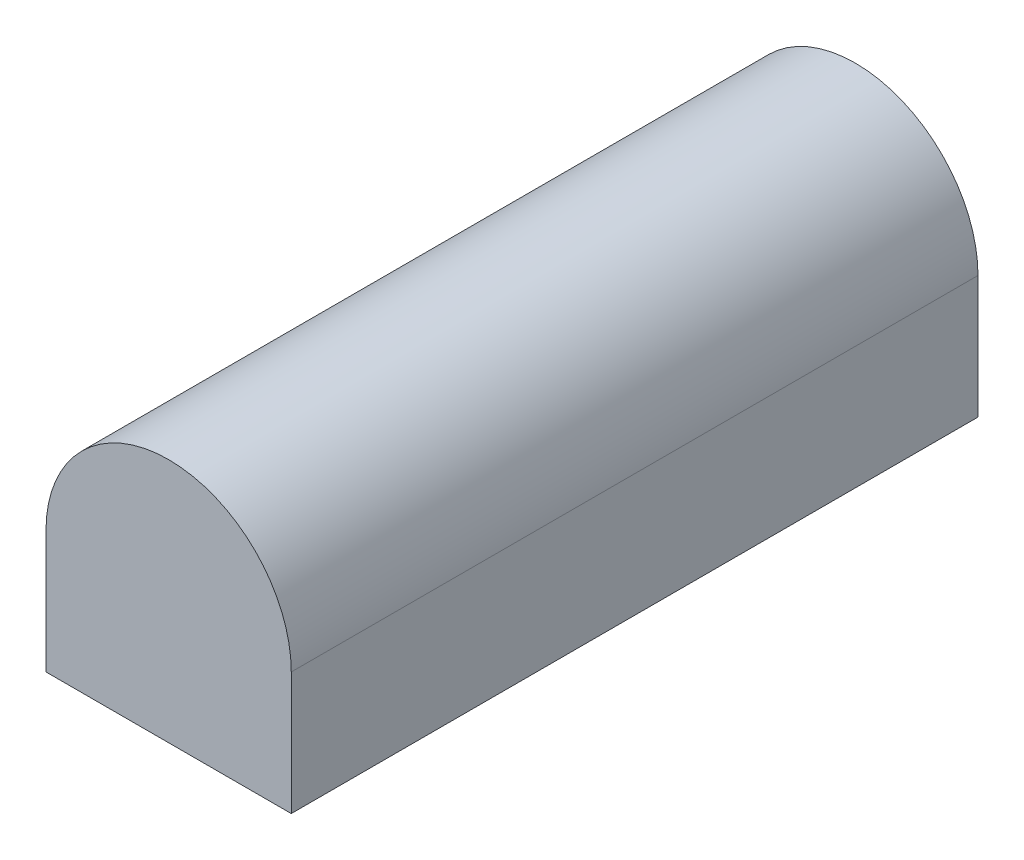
ISO-10303-21;
HEADER;
FILE_DESCRIPTION(('STEP AP214'),'2;1');
FILE_NAME('part.step','',(''),(''),'','','');
FILE_SCHEMA(('AUTOMOTIVE_DESIGN { 1 0 10303 214 1 1 1 1 }'));
ENDSEC;
DATA;
#1=APPLICATION_CONTEXT('core data for automotive mechanical design processes');
#2=APPLICATION_PROTOCOL_DEFINITION('international standard','automotive_design',2000,#1);
#3=PRODUCT_CONTEXT('',#1,'mechanical');
#4=PRODUCT('Part','Part','',(#3));
#5=PRODUCT_RELATED_PRODUCT_CATEGORY('part','',(#4));
#6=PRODUCT_DEFINITION_FORMATION('','',#4);
#7=PRODUCT_DEFINITION_CONTEXT('part definition',#1,'design');
#8=PRODUCT_DEFINITION('design','',#6,#7);
#9=PRODUCT_DEFINITION_SHAPE('','',#8);
#10=(LENGTH_UNIT() NAMED_UNIT(*) SI_UNIT(.MILLI.,.METRE.));
#11=(NAMED_UNIT(*) PLANE_ANGLE_UNIT() SI_UNIT($,.RADIAN.));
#12=(NAMED_UNIT(*) SI_UNIT($,.STERADIAN.) SOLID_ANGLE_UNIT());
#13=UNCERTAINTY_MEASURE_WITH_UNIT(LENGTH_MEASURE(1.E-05),#10,'distance_accuracy_value','');
#14=(GEOMETRIC_REPRESENTATION_CONTEXT(3) GLOBAL_UNCERTAINTY_ASSIGNED_CONTEXT((#13)) GLOBAL_UNIT_ASSIGNED_CONTEXT((#10,
#11,#12)) REPRESENTATION_CONTEXT('',''));
#15=CARTESIAN_POINT('',(0.,0.,0.));
#16=DIRECTION('',(0.,0.,1.));
#17=DIRECTION('',(1.,0.,0.));
#18=AXIS2_PLACEMENT_3D('',#15,#16,#17);
#19=CARTESIAN_POINT('',(3.6432,-3.139537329,18.3432));
#20=DIRECTION('',(0.,1.,0.));
#21=DIRECTION('',(0.,0.,-1.));
#22=AXIS2_PLACEMENT_3D('',#19,#20,#21);
#23=PLANE('',#22);
#24=CARTESIAN_POINT('',(0.,-3.139537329,14.7));
#25=DIRECTION('',(0.,-1.,0.));
#26=DIRECTION('',(0.,0.,-1.));
#27=AXIS2_PLACEMENT_3D('',#24,#25,#26);
#28=CIRCLE('',#27,3.6);
#29=CARTESIAN_POINT('',(0.,-3.139537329,11.1));
#30=VERTEX_POINT('',#29);
#31=EDGE_CURVE('P0_E19',#30,#30,#28,.T.);
#32=ORIENTED_EDGE('',*,*,#31,.F.);
#33=EDGE_LOOP('',(#32));
#34=FACE_BOUND('',#33,.T.);
#35=ADVANCED_FACE('P0_F15',(#34),#23,.T.);
#36=CARTESIAN_POINT('',(0.,26.832462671,14.7));
#37=DIRECTION('',(0.,-1.,0.));
#38=DIRECTION('',(0.,0.,-1.));
#39=AXIS2_PLACEMENT_3D('',#36,#37,#38);
#40=CYLINDRICAL_SURFACE('',#39,3.6);
#41=CARTESIAN_POINT('',(0.,26.832462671,14.7));
#42=DIRECTION('',(0.,-1.,0.));
#43=DIRECTION('',(0.,0.,-1.));
#44=AXIS2_PLACEMENT_3D('',#41,#42,#43);
#45=CIRCLE('',#44,3.6);
#46=CARTESIAN_POINT('',(0.,26.832462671,11.1));
#47=VERTEX_POINT('',#46);
#48=EDGE_CURVE('P0_E205',#47,#47,#45,.T.);
#49=ORIENTED_EDGE('',*,*,#48,.F.);
#50=EDGE_LOOP('',(#49));
#51=FACE_BOUND('',#50,.T.);
#52=ORIENTED_EDGE('',*,*,#31,.T.);
#53=EDGE_LOOP('',(#52));
#54=FACE_BOUND('',#53,.T.);
#55=ADVANCED_FACE('P0_F212',(#51,#54),#40,.F.);
#56=CARTESIAN_POINT('',(5.6672,26.832462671,20.3672));
#57=DIRECTION('',(0.,1.,0.));
#58=DIRECTION('',(0.,0.,-1.));
#59=AXIS2_PLACEMENT_3D('',#56,#57,#58);
#60=PLANE('',#59);
#61=ORIENTED_EDGE('',*,*,#48,.T.);
#62=EDGE_LOOP('',(#61));
#63=FACE_BOUND('',#62,.T.);
#64=CARTESIAN_POINT('',(0.,26.832462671,14.7));
#65=DIRECTION('',(0.,-1.,0.));
#66=DIRECTION('',(0.,0.,-1.));
#67=AXIS2_PLACEMENT_3D('',#64,#65,#66);
#68=CIRCLE('',#67,5.6);
#69=CARTESIAN_POINT('',(0.,26.832462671,9.1));
#70=VERTEX_POINT('',#69);
#71=EDGE_CURVE('P0_E203',#70,#70,#68,.F.);
#72=ORIENTED_EDGE('',*,*,#71,.T.);
#73=EDGE_LOOP('',(#72));
#74=FACE_BOUND('',#73,.T.);
#75=ADVANCED_FACE('P0_F220',(#63,#74),#60,.T.);
#76=CARTESIAN_POINT('',(0.,26.832462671,14.7));
#77=DIRECTION('',(0.,-1.,0.));
#78=DIRECTION('',(0.,0.,-1.));
#79=AXIS2_PLACEMENT_3D('',#76,#77,#78);
#80=CYLINDRICAL_SURFACE('',#79,5.6);
#81=CARTESIAN_POINT('',(0.,-3.139537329,14.7));
#82=DIRECTION('',(0.,-1.,0.));
#83=DIRECTION('',(0.,0.,-1.));
#84=AXIS2_PLACEMENT_3D('',#81,#82,#83);
#85=CIRCLE('',#84,5.6);
#86=CARTESIAN_POINT('',(0.,-3.139537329,9.1));
#87=VERTEX_POINT('',#86);
#88=EDGE_CURVE('P0_E200',#87,#87,#85,.T.);
#89=ORIENTED_EDGE('',*,*,#88,.F.);
#90=EDGE_LOOP('',(#89));
#91=FACE_BOUND('',#90,.T.);
#92=ORIENTED_EDGE('',*,*,#71,.F.);
#93=EDGE_LOOP('',(#92));
#94=FACE_BOUND('',#93,.T.);
#95=ADVANCED_FACE('P0_F317',(#91,#94),#80,.T.);
#96=CARTESIAN_POINT('',(6.28452,-3.139537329,20.98452));
#97=DIRECTION('',(0.,1.,0.));
#98=DIRECTION('',(0.,0.,-1.));
#99=AXIS2_PLACEMENT_3D('',#96,#97,#98);
#100=PLANE('',#99);
#101=ORIENTED_EDGE('',*,*,#88,.T.);
#102=EDGE_LOOP('',(#101));
#103=FACE_BOUND('',#102,.T.);
#104=CARTESIAN_POINT('',(0.,-3.139537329,14.7));
#105=DIRECTION('',(0.,1.,0.));
#106=DIRECTION('',(0.,0.,1.));
#107=AXIS2_PLACEMENT_3D('',#104,#105,#106);
#108=CIRCLE('',#107,6.21);
#109=CARTESIAN_POINT('',(0.,-3.139537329,20.91));
#110=VERTEX_POINT('',#109);
#111=EDGE_CURVE('P0_E197',#110,#110,#108,.T.);
#112=ORIENTED_EDGE('',*,*,#111,.T.);
#113=EDGE_LOOP('',(#112));
#114=FACE_BOUND('',#113,.T.);
#115=ADVANCED_FACE('P0_F315',(#103,#114),#100,.T.);
#116=CARTESIAN_POINT('',(0.,-4.639537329,14.7));
#117=DIRECTION('',(0.,1.,0.));
#118=DIRECTION('',(0.,0.,1.));
#119=AXIS2_PLACEMENT_3D('',#116,#117,#118);
#120=CYLINDRICAL_SURFACE('',#119,6.21);
#121=CARTESIAN_POINT('',(0.,-4.639537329,14.7));
#122=DIRECTION('',(0.,1.,0.));
#123=DIRECTION('',(0.,0.,1.));
#124=AXIS2_PLACEMENT_3D('',#121,#122,#123);
#125=CIRCLE('',#124,6.21);
#126=CARTESIAN_POINT('',(0.,-4.639537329,20.91));
#127=VERTEX_POINT('',#126);
#128=EDGE_CURVE('P0_E194',#127,#127,#125,.F.);
#129=ORIENTED_EDGE('',*,*,#128,.F.);
#130=EDGE_LOOP('',(#129));
#131=FACE_BOUND('',#130,.T.);
#132=ORIENTED_EDGE('',*,*,#111,.F.);
#133=EDGE_LOOP('',(#132));
#134=FACE_BOUND('',#133,.T.);
#135=ADVANCED_FACE('P0_F312',(#131,#134),#120,.T.);
#136=CARTESIAN_POINT('',(8.349,-4.639537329,23.049));
#137=DIRECTION('',(0.,1.,0.));
#138=DIRECTION('',(0.,0.,-1.));
#139=AXIS2_PLACEMENT_3D('',#136,#137,#138);
#140=PLANE('',#139);
#141=ORIENTED_EDGE('',*,*,#128,.T.);
#142=EDGE_LOOP('',(#141));
#143=FACE_BOUND('',#142,.T.);
#144=CARTESIAN_POINT('',(0.,-4.639537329,14.7));
#145=DIRECTION('',(0.,1.,0.));
#146=DIRECTION('',(0.,0.,1.));
#147=AXIS2_PLACEMENT_3D('',#144,#145,#146);
#148=CIRCLE('',#147,8.25);
#149=CARTESIAN_POINT('',(0.,-4.639537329,22.95));
#150=VERTEX_POINT('',#149);
#151=EDGE_CURVE('P0_E191',#150,#150,#148,.F.);
#152=ORIENTED_EDGE('',*,*,#151,.F.);
#153=EDGE_LOOP('',(#152));
#154=FACE_BOUND('',#153,.T.);
#155=ADVANCED_FACE('P0_F310',(#143,#154),#140,.T.);
#156=CARTESIAN_POINT('',(0.,-4.639537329,14.7));
#157=DIRECTION('',(0.,1.,0.));
#158=DIRECTION('',(0.,0.,1.));
#159=AXIS2_PLACEMENT_3D('',#156,#157,#158);
#160=CYLINDRICAL_SURFACE('',#159,8.25);
#161=CARTESIAN_POINT('',(0.,-3.139537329,14.7));
#162=DIRECTION('',(0.,1.,0.));
#163=DIRECTION('',(0.,0.,1.));
#164=AXIS2_PLACEMENT_3D('',#161,#162,#163);
#165=CIRCLE('',#164,8.25);
#166=CARTESIAN_POINT('',(0.,-3.139537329,22.95));
#167=VERTEX_POINT('',#166);
#168=EDGE_CURVE('P0_E188',#167,#167,#165,.F.);
#169=ORIENTED_EDGE('',*,*,#168,.F.);
#170=EDGE_LOOP('',(#169));
#171=FACE_BOUND('',#170,.T.);
#172=ORIENTED_EDGE('',*,*,#151,.T.);
#173=EDGE_LOOP('',(#172));
#174=FACE_BOUND('',#173,.T.);
#175=ADVANCED_FACE('P0_F306',(#171,#174),#160,.F.);
#176=CARTESIAN_POINT('',(-5.7938,-12.005737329,43.86));
#177=DIRECTION('',(0.,0.,1.));
#178=DIRECTION('',(0.,1.,0.));
#179=AXIS2_PLACEMENT_3D('',#176,#177,#178);
#180=PLANE('',#179);
#181=CARTESIAN_POINT('',(-7.16,-10.639537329,43.86));
#182=DIRECTION('',(0.,0.,-1.));
#183=DIRECTION('',(-1.,0.,0.));
#184=AXIS2_PLACEMENT_3D('',#181,#182,#183);
#185=CIRCLE('',#184,1.35);
#186=CARTESIAN_POINT('',(-8.51,-10.639537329,43.86));
#187=VERTEX_POINT('',#186);
#188=EDGE_CURVE('P0_E185',#187,#187,#185,.F.);
#189=ORIENTED_EDGE('',*,*,#188,.T.);
#190=EDGE_LOOP('',(#189));
#191=FACE_BOUND('',#190,.T.);
#192=ADVANCED_FACE('P0_F309',(#191),#180,.T.);
#193=CARTESIAN_POINT('',(3.6662,-11.005737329,43.86));
#194=DIRECTION('',(0.,0.,1.));
#195=DIRECTION('',(0.,1.,0.));
#196=AXIS2_PLACEMENT_3D('',#193,#194,#195);
#197=PLANE('',#196);
#198=CARTESIAN_POINT('',(2.3,-9.639537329,43.86));
#199=DIRECTION('',(0.,0.,-1.));
#200=DIRECTION('',(-1.,0.,0.));
#201=AXIS2_PLACEMENT_3D('',#198,#199,#200);
#202=CIRCLE('',#201,1.35);
#203=CARTESIAN_POINT('',(0.949999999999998,-9.639537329,43.86));
#204=VERTEX_POINT('',#203);
#205=EDGE_CURVE('P0_E182',#204,#204,#202,.F.);
#206=ORIENTED_EDGE('',*,*,#205,.T.);
#207=EDGE_LOOP('',(#206));
#208=FACE_BOUND('',#207,.T.);
#209=ADVANCED_FACE('P0_F341',(#208),#197,.T.);
#210=CARTESIAN_POINT('',(8.3662,-11.005737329,43.86));
#211=DIRECTION('',(0.,0.,1.));
#212=DIRECTION('',(0.,1.,0.));
#213=AXIS2_PLACEMENT_3D('',#210,#211,#212);
#214=PLANE('',#213);
#215=CARTESIAN_POINT('',(7.,-9.639537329,43.86));
#216=DIRECTION('',(0.,0.,-1.));
#217=DIRECTION('',(-1.,0.,0.));
#218=AXIS2_PLACEMENT_3D('',#215,#216,#217);
#219=CIRCLE('',#218,1.35);
#220=CARTESIAN_POINT('',(5.65,-9.639537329,43.86));
#221=VERTEX_POINT('',#220);
#222=EDGE_CURVE('P0_E179',#221,#221,#219,.F.);
#223=ORIENTED_EDGE('',*,*,#222,.T.);
#224=EDGE_LOOP('',(#223));
#225=FACE_BOUND('',#224,.T.);
#226=ADVANCED_FACE('P0_F345',(#225),#214,.T.);
#227=CARTESIAN_POINT('',(-5.7338,-17.005737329,43.86));
#228=DIRECTION('',(0.,0.,1.));
#229=DIRECTION('',(0.,1.,0.));
#230=AXIS2_PLACEMENT_3D('',#227,#228,#229);
#231=PLANE('',#230);
#232=CARTESIAN_POINT('',(-7.1,-15.639537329,43.86));
#233=DIRECTION('',(0.,0.,-1.));
#234=DIRECTION('',(-1.,0.,0.));
#235=AXIS2_PLACEMENT_3D('',#232,#233,#234);
#236=CIRCLE('',#235,1.34999999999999);
#237=CARTESIAN_POINT('',(-8.44999999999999,-15.639537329,43.86));
#238=VERTEX_POINT('',#237);
#239=EDGE_CURVE('P0_E176',#238,#238,#236,.F.);
#240=ORIENTED_EDGE('',*,*,#239,.T.);
#241=EDGE_LOOP('',(#240));
#242=FACE_BOUND('',#241,.T.);
#243=ADVANCED_FACE('P0_F349',(#242),#231,.T.);
#244=CARTESIAN_POINT('',(3.6662,-17.005737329,43.86));
#245=DIRECTION('',(0.,0.,1.));
#246=DIRECTION('',(0.,1.,0.));
#247=AXIS2_PLACEMENT_3D('',#244,#245,#246);
#248=PLANE('',#247);
#249=CARTESIAN_POINT('',(2.3,-15.639537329,43.86));
#250=DIRECTION('',(0.,0.,-1.));
#251=DIRECTION('',(-1.,0.,0.));
#252=AXIS2_PLACEMENT_3D('',#249,#250,#251);
#253=CIRCLE('',#252,1.34999999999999);
#254=CARTESIAN_POINT('',(0.950000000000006,-15.639537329,43.86));
#255=VERTEX_POINT('',#254);
#256=EDGE_CURVE('P0_E173',#255,#255,#253,.F.);
#257=ORIENTED_EDGE('',*,*,#256,.T.);
#258=EDGE_LOOP('',(#257));
#259=FACE_BOUND('',#258,.T.);
#260=ADVANCED_FACE('P0_F353',(#259),#248,.T.);
#261=CARTESIAN_POINT('',(8.3662,-17.005737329,43.86));
#262=DIRECTION('',(0.,0.,1.));
#263=DIRECTION('',(0.,1.,0.));
#264=AXIS2_PLACEMENT_3D('',#261,#262,#263);
#265=PLANE('',#264);
#266=CARTESIAN_POINT('',(7.,-15.639537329,43.86));
#267=DIRECTION('',(0.,0.,-1.));
#268=DIRECTION('',(-1.,0.,0.));
#269=AXIS2_PLACEMENT_3D('',#266,#267,#268);
#270=CIRCLE('',#269,1.34999999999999);
#271=CARTESIAN_POINT('',(5.65000000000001,-15.639537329,43.86));
#272=VERTEX_POINT('',#271);
#273=EDGE_CURVE('P0_E170',#272,#272,#270,.F.);
#274=ORIENTED_EDGE('',*,*,#273,.T.);
#275=EDGE_LOOP('',(#274));
#276=FACE_BOUND('',#275,.T.);
#277=ADVANCED_FACE('P0_F357',(#276),#265,.T.);
#278=CARTESIAN_POINT('',(-1.1938,-15.505737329,43.86));
#279=DIRECTION('',(0.,0.,1.));
#280=DIRECTION('',(0.,1.,0.));
#281=AXIS2_PLACEMENT_3D('',#278,#279,#280);
#282=PLANE('',#281);
#283=CARTESIAN_POINT('',(-2.56,-14.139537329,43.86));
#284=DIRECTION('',(0.,0.,-1.));
#285=DIRECTION('',(-1.,0.,0.));
#286=AXIS2_PLACEMENT_3D('',#283,#284,#285);
#287=CIRCLE('',#286,1.35);
#288=CARTESIAN_POINT('',(-3.91,-14.139537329,43.86));
#289=VERTEX_POINT('',#288);
#290=EDGE_CURVE('P0_E167',#289,#289,#287,.F.);
#291=ORIENTED_EDGE('',*,*,#290,.T.);
#292=EDGE_LOOP('',(#291));
#293=FACE_BOUND('',#292,.T.);
#294=ADVANCED_FACE('P0_F361',(#293),#282,.T.);
#295=CARTESIAN_POINT('',(10.024872,-3.139537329,24.724872));
#296=DIRECTION('',(0.,1.,0.));
#297=DIRECTION('',(0.,0.,-1.));
#298=AXIS2_PLACEMENT_3D('',#295,#296,#297);
#299=PLANE('',#298);
#300=ORIENTED_EDGE('',*,*,#168,.T.);
#301=EDGE_LOOP('',(#300));
#302=FACE_BOUND('',#301,.T.);
#303=CARTESIAN_POINT('',(0.,-3.139537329,14.7));
#304=DIRECTION('',(0.,-1.,0.));
#305=DIRECTION('',(1.,0.,0.));
#306=AXIS2_PLACEMENT_3D('',#303,#304,#305);
#307=CIRCLE('',#306,9.906);
#308=CARTESIAN_POINT('',(9.906,-3.139537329,14.7));
#309=VERTEX_POINT('',#308);
#310=EDGE_CURVE('P0_E164',#309,#309,#307,.F.);
#311=ORIENTED_EDGE('',*,*,#310,.T.);
#312=EDGE_LOOP('',(#311));
#313=FACE_BOUND('',#312,.T.);
#314=ADVANCED_FACE('P0_F304',(#302,#313),#299,.T.);
#315=CARTESIAN_POINT('',(-7.16,-10.639537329,43.86));
#316=DIRECTION('',(0.,0.,-1.));
#317=DIRECTION('',(-1.,0.,0.));
#318=AXIS2_PLACEMENT_3D('',#315,#316,#317);
#319=CYLINDRICAL_SURFACE('',#318,1.35);
#320=CARTESIAN_POINT('',(-7.16,-10.639537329,36.86));
#321=DIRECTION('',(0.,0.,-1.));
#322=DIRECTION('',(-1.,0.,0.));
#323=AXIS2_PLACEMENT_3D('',#320,#321,#322);
#324=CIRCLE('',#323,1.35);
#325=CARTESIAN_POINT('',(-8.51,-10.639537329,36.86));
#326=VERTEX_POINT('',#325);
#327=EDGE_CURVE('P0_E161',#326,#326,#324,.T.);
#328=ORIENTED_EDGE('',*,*,#327,.F.);
#329=EDGE_LOOP('',(#328));
#330=FACE_BOUND('',#329,.T.);
#331=ORIENTED_EDGE('',*,*,#188,.F.);
#332=EDGE_LOOP('',(#331));
#333=FACE_BOUND('',#332,.T.);
#334=ADVANCED_FACE('P0_F300',(#330,#333),#319,.T.);
#335=CARTESIAN_POINT('',(2.3,-9.639537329,43.86));
#336=DIRECTION('',(0.,0.,-1.));
#337=DIRECTION('',(-1.,0.,0.));
#338=AXIS2_PLACEMENT_3D('',#335,#336,#337);
#339=CYLINDRICAL_SURFACE('',#338,1.35);
#340=CARTESIAN_POINT('',(2.3,-9.639537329,36.86));
#341=DIRECTION('',(0.,0.,-1.));
#342=DIRECTION('',(-1.,0.,0.));
#343=AXIS2_PLACEMENT_3D('',#340,#341,#342);
#344=CIRCLE('',#343,1.35);
#345=CARTESIAN_POINT('',(0.949999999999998,-9.639537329,36.86));
#346=VERTEX_POINT('',#345);
#347=EDGE_CURVE('P0_E158',#346,#346,#344,.T.);
#348=ORIENTED_EDGE('',*,*,#347,.F.);
#349=EDGE_LOOP('',(#348));
#350=FACE_BOUND('',#349,.T.);
#351=ORIENTED_EDGE('',*,*,#205,.F.);
#352=EDGE_LOOP('',(#351));
#353=FACE_BOUND('',#352,.T.);
#354=ADVANCED_FACE('P0_F296',(#350,#353),#339,.T.);
#355=CARTESIAN_POINT('',(7.,-9.639537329,43.86));
#356=DIRECTION('',(0.,0.,-1.));
#357=DIRECTION('',(-1.,0.,0.));
#358=AXIS2_PLACEMENT_3D('',#355,#356,#357);
#359=CYLINDRICAL_SURFACE('',#358,1.35);
#360=CARTESIAN_POINT('',(7.,-9.639537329,36.86));
#361=DIRECTION('',(0.,0.,-1.));
#362=DIRECTION('',(-1.,0.,0.));
#363=AXIS2_PLACEMENT_3D('',#360,#361,#362);
#364=CIRCLE('',#363,1.35);
#365=CARTESIAN_POINT('',(5.65,-9.639537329,36.86));
#366=VERTEX_POINT('',#365);
#367=EDGE_CURVE('P0_E155',#366,#366,#364,.T.);
#368=ORIENTED_EDGE('',*,*,#367,.F.);
#369=EDGE_LOOP('',(#368));
#370=FACE_BOUND('',#369,.T.);
#371=ORIENTED_EDGE('',*,*,#222,.F.);
#372=EDGE_LOOP('',(#371));
#373=FACE_BOUND('',#372,.T.);
#374=ADVANCED_FACE('P0_F292',(#370,#373),#359,.T.);
#375=CARTESIAN_POINT('',(-7.1,-15.639537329,43.86));
#376=DIRECTION('',(0.,0.,-1.));
#377=DIRECTION('',(-1.,0.,0.));
#378=AXIS2_PLACEMENT_3D('',#375,#376,#377);
#379=CYLINDRICAL_SURFACE('',#378,1.34999999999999);
#380=CARTESIAN_POINT('',(-7.1,-15.639537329,36.86));
#381=DIRECTION('',(0.,0.,-1.));
#382=DIRECTION('',(-1.,0.,0.));
#383=AXIS2_PLACEMENT_3D('',#380,#381,#382);
#384=CIRCLE('',#383,1.34999999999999);
#385=CARTESIAN_POINT('',(-8.44999999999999,-15.639537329,36.86));
#386=VERTEX_POINT('',#385);
#387=EDGE_CURVE('P0_E152',#386,#386,#384,.T.);
#388=ORIENTED_EDGE('',*,*,#387,.F.);
#389=EDGE_LOOP('',(#388));
#390=FACE_BOUND('',#389,.T.);
#391=ORIENTED_EDGE('',*,*,#239,.F.);
#392=EDGE_LOOP('',(#391));
#393=FACE_BOUND('',#392,.T.);
#394=ADVANCED_FACE('P0_F288',(#390,#393),#379,.T.);
#395=CARTESIAN_POINT('',(2.3,-15.639537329,43.86));
#396=DIRECTION('',(0.,0.,-1.));
#397=DIRECTION('',(-1.,0.,0.));
#398=AXIS2_PLACEMENT_3D('',#395,#396,#397);
#399=CYLINDRICAL_SURFACE('',#398,1.34999999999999);
#400=CARTESIAN_POINT('',(2.3,-15.639537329,36.86));
#401=DIRECTION('',(0.,0.,-1.));
#402=DIRECTION('',(-1.,0.,0.));
#403=AXIS2_PLACEMENT_3D('',#400,#401,#402);
#404=CIRCLE('',#403,1.34999999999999);
#405=CARTESIAN_POINT('',(0.950000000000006,-15.639537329,36.86));
#406=VERTEX_POINT('',#405);
#407=EDGE_CURVE('P0_E149',#406,#406,#404,.T.);
#408=ORIENTED_EDGE('',*,*,#407,.F.);
#409=EDGE_LOOP('',(#408));
#410=FACE_BOUND('',#409,.T.);
#411=ORIENTED_EDGE('',*,*,#256,.F.);
#412=EDGE_LOOP('',(#411));
#413=FACE_BOUND('',#412,.T.);
#414=ADVANCED_FACE('P0_F284',(#410,#413),#399,.T.);
#415=CARTESIAN_POINT('',(7.,-15.639537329,43.86));
#416=DIRECTION('',(0.,0.,-1.));
#417=DIRECTION('',(-1.,0.,0.));
#418=AXIS2_PLACEMENT_3D('',#415,#416,#417);
#419=CYLINDRICAL_SURFACE('',#418,1.34999999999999);
#420=CARTESIAN_POINT('',(7.,-15.639537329,36.86));
#421=DIRECTION('',(0.,0.,-1.));
#422=DIRECTION('',(-1.,0.,0.));
#423=AXIS2_PLACEMENT_3D('',#420,#421,#422);
#424=CIRCLE('',#423,1.34999999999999);
#425=CARTESIAN_POINT('',(5.65000000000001,-15.639537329,36.86));
#426=VERTEX_POINT('',#425);
#427=EDGE_CURVE('P0_E146',#426,#426,#424,.T.);
#428=ORIENTED_EDGE('',*,*,#427,.F.);
#429=EDGE_LOOP('',(#428));
#430=FACE_BOUND('',#429,.T.);
#431=ORIENTED_EDGE('',*,*,#273,.F.);
#432=EDGE_LOOP('',(#431));
#433=FACE_BOUND('',#432,.T.);
#434=ADVANCED_FACE('P0_F280',(#430,#433),#419,.T.);
#435=CARTESIAN_POINT('',(-2.56,-14.139537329,43.86));
#436=DIRECTION('',(0.,0.,-1.));
#437=DIRECTION('',(-1.,0.,0.));
#438=AXIS2_PLACEMENT_3D('',#435,#436,#437);
#439=CYLINDRICAL_SURFACE('',#438,1.35);
#440=CARTESIAN_POINT('',(-2.56,-14.139537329,36.86));
#441=DIRECTION('',(0.,0.,-1.));
#442=DIRECTION('',(-1.,0.,0.));
#443=AXIS2_PLACEMENT_3D('',#440,#441,#442);
#444=CIRCLE('',#443,1.35);
#445=CARTESIAN_POINT('',(-3.91,-14.139537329,36.86));
#446=VERTEX_POINT('',#445);
#447=EDGE_CURVE('P0_E86',#446,#446,#444,.T.);
#448=ORIENTED_EDGE('',*,*,#447,.F.);
#449=EDGE_LOOP('',(#448));
#450=FACE_BOUND('',#449,.T.);
#451=ORIENTED_EDGE('',*,*,#290,.F.);
#452=EDGE_LOOP('',(#451));
#453=FACE_BOUND('',#452,.T.);
#454=ADVANCED_FACE('P0_F277',(#450,#453),#439,.T.);
#455=CARTESIAN_POINT('',(0.,-18.139537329,14.7));
#456=DIRECTION('',(0.,1.,0.));
#457=DIRECTION('',(0.,0.,1.));
#458=AXIS2_PLACEMENT_3D('',#455,#456,#457);
#459=CYLINDRICAL_SURFACE('',#458,10.16);
#460=CARTESIAN_POINT('',(0.,-18.139537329,14.7));
#461=DIRECTION('',(0.,1.,0.));
#462=DIRECTION('',(0.,0.,1.));
#463=AXIS2_PLACEMENT_3D('',#460,#461,#462);
#464=CIRCLE('',#463,10.16);
#465=CARTESIAN_POINT('',(-10.16,-18.139537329,14.7));
#466=VERTEX_POINT('',#465);
#467=CARTESIAN_POINT('',(10.16,-18.139537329,14.7));
#468=VERTEX_POINT('',#467);
#469=EDGE_CURVE('P0_E58',#466,#468,#464,.F.);
#470=ORIENTED_EDGE('',*,*,#469,.F.);
#471=DIRECTION('',(0.,1.,0.));
#472=VECTOR('',#471,1.);
#473=CARTESIAN_POINT('',(-10.16,-12.139537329,14.7));
#474=LINE('',#473,#472);
#475=CARTESIAN_POINT('',(-10.16,-6.139537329,14.7));
#476=VERTEX_POINT('',#475);
#477=EDGE_CURVE('P0_E62',#466,#476,#474,.T.);
#478=ORIENTED_EDGE('',*,*,#477,.T.);
#479=CARTESIAN_POINT('',(0.,-6.139537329,14.7));
#480=DIRECTION('',(0.,1.,0.));
#481=DIRECTION('',(0.,0.,1.));
#482=AXIS2_PLACEMENT_3D('',#479,#480,#481);
#483=CIRCLE('',#482,10.16);
#484=CARTESIAN_POINT('',(10.16,-6.139537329,14.7));
#485=VERTEX_POINT('',#484);
#486=EDGE_CURVE('P0_E142',#476,#485,#483,.F.);
#487=ORIENTED_EDGE('',*,*,#486,.T.);
#488=DIRECTION('',(0.,-1.,0.));
#489=VECTOR('',#488,1.);
#490=CARTESIAN_POINT('',(10.16,-12.139537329,14.7));
#491=LINE('',#490,#489);
#492=EDGE_CURVE('P0_E55',#485,#468,#491,.T.);
#493=ORIENTED_EDGE('',*,*,#492,.T.);
#494=EDGE_LOOP('',(#470,#478,#487,#493));
#495=FACE_BOUND('',#494,.T.);
#496=ADVANCED_FACE('P0_F60',(#495),#459,.T.);
#497=CARTESIAN_POINT('',(0.,-3.139537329,14.7));
#498=DIRECTION('',(0.,-1.,0.));
#499=DIRECTION('',(1.,0.,0.));
#500=AXIS2_PLACEMENT_3D('',#497,#498,#499);
#501=CYLINDRICAL_SURFACE('',#500,9.906);
#502=ORIENTED_EDGE('',*,*,#310,.F.);
#503=EDGE_LOOP('',(#502));
#504=FACE_BOUND('',#503,.T.);
#505=CARTESIAN_POINT('',(0.,-6.139537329,14.7));
#506=DIRECTION('',(0.,-1.,0.));
#507=DIRECTION('',(1.,0.,0.));
#508=AXIS2_PLACEMENT_3D('',#505,#506,#507);
#509=CIRCLE('',#508,9.906);
#510=CARTESIAN_POINT('',(9.906,-6.139537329,14.7));
#511=VERTEX_POINT('',#510);
#512=EDGE_CURVE('P0_E139',#511,#511,#509,.F.);
#513=ORIENTED_EDGE('',*,*,#512,.T.);
#514=EDGE_LOOP('',(#513));
#515=FACE_BOUND('',#514,.T.);
#516=ADVANCED_FACE('P0_F270',(#504,#515),#501,.T.);
#517=CARTESIAN_POINT('',(-4.883,-12.916537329,36.86));
#518=DIRECTION('',(0.,0.,1.));
#519=DIRECTION('',(0.,1.,0.));
#520=AXIS2_PLACEMENT_3D('',#517,#518,#519);
#521=PLANE('',#520);
#522=ORIENTED_EDGE('',*,*,#327,.T.);
#523=EDGE_LOOP('',(#522));
#524=FACE_BOUND('',#523,.T.);
#525=CARTESIAN_POINT('',(-7.16,-10.639537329,36.86));
#526=DIRECTION('',(0.,0.,-1.));
#527=DIRECTION('',(-1.,0.,0.));
#528=AXIS2_PLACEMENT_3D('',#525,#526,#527);
#529=CIRCLE('',#528,2.25);
#530=CARTESIAN_POINT('',(-9.41,-10.639537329,36.86));
#531=VERTEX_POINT('',#530);
#532=EDGE_CURVE('P0_E136',#531,#531,#529,.F.);
#533=ORIENTED_EDGE('',*,*,#532,.T.);
#534=EDGE_LOOP('',(#533));
#535=FACE_BOUND('',#534,.T.);
#536=ADVANCED_FACE('P0_F273',(#524,#535),#521,.T.);
#537=CARTESIAN_POINT('',(4.577,-11.916537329,36.86));
#538=DIRECTION('',(0.,0.,1.));
#539=DIRECTION('',(0.,1.,0.));
#540=AXIS2_PLACEMENT_3D('',#537,#538,#539);
#541=PLANE('',#540);
#542=ORIENTED_EDGE('',*,*,#347,.T.);
#543=EDGE_LOOP('',(#542));
#544=FACE_BOUND('',#543,.T.);
#545=CARTESIAN_POINT('',(2.3,-9.639537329,36.86));
#546=DIRECTION('',(0.,0.,-1.));
#547=DIRECTION('',(-1.,0.,0.));
#548=AXIS2_PLACEMENT_3D('',#545,#546,#547);
#549=CIRCLE('',#548,2.25);
#550=CARTESIAN_POINT('',(0.049999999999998,-9.639537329,36.86));
#551=VERTEX_POINT('',#550);
#552=EDGE_CURVE('P0_E133',#551,#551,#549,.F.);
#553=ORIENTED_EDGE('',*,*,#552,.T.);
#554=EDGE_LOOP('',(#553));
#555=FACE_BOUND('',#554,.T.);
#556=ADVANCED_FACE('P0_F371',(#544,#555),#541,.T.);
#557=CARTESIAN_POINT('',(9.277,-11.916537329,36.86));
#558=DIRECTION('',(0.,0.,1.));
#559=DIRECTION('',(0.,1.,0.));
#560=AXIS2_PLACEMENT_3D('',#557,#558,#559);
#561=PLANE('',#560);
#562=ORIENTED_EDGE('',*,*,#367,.T.);
#563=EDGE_LOOP('',(#562));
#564=FACE_BOUND('',#563,.T.);
#565=CARTESIAN_POINT('',(7.,-9.639537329,36.86));
#566=DIRECTION('',(0.,0.,-1.));
#567=DIRECTION('',(-1.,0.,0.));
#568=AXIS2_PLACEMENT_3D('',#565,#566,#567);
#569=CIRCLE('',#568,2.25);
#570=CARTESIAN_POINT('',(4.75,-9.639537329,36.86));
#571=VERTEX_POINT('',#570);
#572=EDGE_CURVE('P0_E130',#571,#571,#569,.F.);
#573=ORIENTED_EDGE('',*,*,#572,.T.);
#574=EDGE_LOOP('',(#573));
#575=FACE_BOUND('',#574,.T.);
#576=ADVANCED_FACE('P0_F375',(#564,#575),#561,.T.);
#577=CARTESIAN_POINT('',(-4.823,-17.916537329,36.86));
#578=DIRECTION('',(0.,0.,1.));
#579=DIRECTION('',(0.,1.,0.));
#580=AXIS2_PLACEMENT_3D('',#577,#578,#579);
#581=PLANE('',#580);
#582=ORIENTED_EDGE('',*,*,#387,.T.);
#583=EDGE_LOOP('',(#582));
#584=FACE_BOUND('',#583,.T.);
#585=CARTESIAN_POINT('',(-7.1,-15.639537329,36.86));
#586=DIRECTION('',(0.,0.,-1.));
#587=DIRECTION('',(-1.,0.,0.));
#588=AXIS2_PLACEMENT_3D('',#585,#586,#587);
#589=CIRCLE('',#588,2.25);
#590=CARTESIAN_POINT('',(-9.35,-15.639537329,36.86));
#591=VERTEX_POINT('',#590);
#592=EDGE_CURVE('P0_E127',#591,#591,#589,.F.);
#593=ORIENTED_EDGE('',*,*,#592,.T.);
#594=EDGE_LOOP('',(#593));
#595=FACE_BOUND('',#594,.T.);
#596=ADVANCED_FACE('P0_F379',(#584,#595),#581,.T.);
#597=CARTESIAN_POINT('',(4.577,-17.916537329,36.86));
#598=DIRECTION('',(0.,0.,1.));
#599=DIRECTION('',(0.,1.,0.));
#600=AXIS2_PLACEMENT_3D('',#597,#598,#599);
#601=PLANE('',#600);
#602=ORIENTED_EDGE('',*,*,#407,.T.);
#603=EDGE_LOOP('',(#602));
#604=FACE_BOUND('',#603,.T.);
#605=CARTESIAN_POINT('',(2.3,-15.639537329,36.86));
#606=DIRECTION('',(0.,0.,-1.));
#607=DIRECTION('',(-1.,0.,0.));
#608=AXIS2_PLACEMENT_3D('',#605,#606,#607);
#609=CIRCLE('',#608,2.25);
#610=CARTESIAN_POINT('',(0.0500000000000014,-15.639537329,36.86));
#611=VERTEX_POINT('',#610);
#612=EDGE_CURVE('P0_E124',#611,#611,#609,.F.);
#613=ORIENTED_EDGE('',*,*,#612,.T.);
#614=EDGE_LOOP('',(#613));
#615=FACE_BOUND('',#614,.T.);
#616=ADVANCED_FACE('P0_F383',(#604,#615),#601,.T.);
#617=CARTESIAN_POINT('',(9.277,-17.916537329,36.86));
#618=DIRECTION('',(0.,0.,1.));
#619=DIRECTION('',(0.,1.,0.));
#620=AXIS2_PLACEMENT_3D('',#617,#618,#619);
#621=PLANE('',#620);
#622=ORIENTED_EDGE('',*,*,#427,.T.);
#623=EDGE_LOOP('',(#622));
#624=FACE_BOUND('',#623,.T.);
#625=CARTESIAN_POINT('',(7.,-15.639537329,36.86));
#626=DIRECTION('',(0.,0.,-1.));
#627=DIRECTION('',(-1.,0.,0.));
#628=AXIS2_PLACEMENT_3D('',#625,#626,#627);
#629=CIRCLE('',#628,2.25);
#630=CARTESIAN_POINT('',(4.75,-15.639537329,36.86));
#631=VERTEX_POINT('',#630);
#632=EDGE_CURVE('P0_E121',#631,#631,#629,.F.);
#633=ORIENTED_EDGE('',*,*,#632,.T.);
#634=EDGE_LOOP('',(#633));
#635=FACE_BOUND('',#634,.T.);
#636=ADVANCED_FACE('P0_F387',(#624,#635),#621,.T.);
#637=CARTESIAN_POINT('',(-0.283,-16.416537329,36.86));
#638=DIRECTION('',(0.,0.,1.));
#639=DIRECTION('',(0.,1.,0.));
#640=AXIS2_PLACEMENT_3D('',#637,#638,#639);
#641=PLANE('',#640);
#642=ORIENTED_EDGE('',*,*,#447,.T.);
#643=EDGE_LOOP('',(#642));
#644=FACE_BOUND('',#643,.T.);
#645=CARTESIAN_POINT('',(-2.56,-14.139537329,36.86));
#646=DIRECTION('',(0.,0.,-1.));
#647=DIRECTION('',(-1.,0.,0.));
#648=AXIS2_PLACEMENT_3D('',#645,#646,#647);
#649=CIRCLE('',#648,2.25);
#650=CARTESIAN_POINT('',(-4.81,-14.139537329,36.86));
#651=VERTEX_POINT('',#650);
#652=EDGE_CURVE('P0_E88',#651,#651,#649,.F.);
#653=ORIENTED_EDGE('',*,*,#652,.T.);
#654=EDGE_LOOP('',(#653));
#655=FACE_BOUND('',#654,.T.);
#656=ADVANCED_FACE('P0_F391',(#644,#655),#641,.T.);
#657=CARTESIAN_POINT('',(10.16,-6.139537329,14.7));
#658=DIRECTION('',(-1.,0.,0.));
#659=DIRECTION('',(0.,-1.,0.));
#660=AXIS2_PLACEMENT_3D('',#657,#658,#659);
#661=PLANE('',#660);
#662=DIRECTION('',(0.,-1.,0.));
#663=VECTOR('',#662,1.);
#664=CARTESIAN_POINT('',(10.16,-12.139537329,24.86));
#665=LINE('',#664,#663);
#666=CARTESIAN_POINT('',(10.16,-6.139537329,24.86));
#667=VERTEX_POINT('',#666);
#668=CARTESIAN_POINT('',(10.16,-18.139537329,24.86));
#669=VERTEX_POINT('',#668);
#670=EDGE_CURVE('P0_E87',#667,#669,#665,.T.);
#671=ORIENTED_EDGE('',*,*,#670,.T.);
#672=DIRECTION('',(0.,0.,1.));
#673=VECTOR('',#672,1.);
#674=CARTESIAN_POINT('',(10.16,-18.139537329,14.63904));
#675=LINE('',#674,#673);
#676=EDGE_CURVE('P0_E65',#468,#669,#675,.T.);
#677=ORIENTED_EDGE('',*,*,#676,.F.);
#678=ORIENTED_EDGE('',*,*,#492,.F.);
#679=DIRECTION('',(0.,0.,1.));
#680=VECTOR('',#679,1.);
#681=CARTESIAN_POINT('',(10.16,-6.139537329,14.63904));
#682=LINE('',#681,#680);
#683=EDGE_CURVE('P0_E75',#485,#667,#682,.T.);
#684=ORIENTED_EDGE('',*,*,#683,.T.);
#685=EDGE_LOOP('',(#671,#677,#678,#684));
#686=FACE_BOUND('',#685,.T.);
#687=ADVANCED_FACE('P0_F395',(#686),#661,.F.);
#688=CARTESIAN_POINT('',(10.16,-18.139537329,4.41808));
#689=DIRECTION('',(0.,-1.,0.));
#690=DIRECTION('',(0.,0.,1.));
#691=AXIS2_PLACEMENT_3D('',#688,#689,#690);
#692=PLANE('',#691);
#693=DIRECTION('',(-1.,0.,0.));
#694=VECTOR('',#693,1.);
#695=CARTESIAN_POINT('',(0.,-18.139537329,24.86));
#696=LINE('',#695,#694);
#697=CARTESIAN_POINT('',(-10.16,-18.139537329,24.86));
#698=VERTEX_POINT('',#697);
#699=EDGE_CURVE('P0_E70',#669,#698,#696,.T.);
#700=ORIENTED_EDGE('',*,*,#699,.T.);
#701=DIRECTION('',(0.,0.,-1.));
#702=VECTOR('',#701,1.);
#703=CARTESIAN_POINT('',(-10.16,-18.139537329,19.78));
#704=LINE('',#703,#702);
#705=EDGE_CURVE('P0_E67',#698,#466,#704,.T.);
#706=ORIENTED_EDGE('',*,*,#705,.T.);
#707=ORIENTED_EDGE('',*,*,#469,.T.);
#708=ORIENTED_EDGE('',*,*,#676,.T.);
#709=EDGE_LOOP('',(#700,#706,#707,#708));
#710=FACE_BOUND('',#709,.T.);
#711=ADVANCED_FACE('P0_F68',(#710),#692,.T.);
#712=CARTESIAN_POINT('',(-10.16,-6.139537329,14.7));
#713=DIRECTION('',(1.,0.,0.));
#714=DIRECTION('',(0.,0.,1.));
#715=AXIS2_PLACEMENT_3D('',#712,#713,#714);
#716=PLANE('',#715);
#717=ORIENTED_EDGE('',*,*,#477,.F.);
#718=ORIENTED_EDGE('',*,*,#705,.F.);
#719=DIRECTION('',(0.,1.,0.));
#720=VECTOR('',#719,1.);
#721=CARTESIAN_POINT('',(-10.16,-12.139537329,24.86));
#722=LINE('',#721,#720);
#723=CARTESIAN_POINT('',(-10.16,-6.139537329,24.86));
#724=VERTEX_POINT('',#723);
#725=EDGE_CURVE('P0_E34',#698,#724,#722,.T.);
#726=ORIENTED_EDGE('',*,*,#725,.T.);
#727=DIRECTION('',(0.,0.,-1.));
#728=VECTOR('',#727,1.);
#729=CARTESIAN_POINT('',(-10.16,-6.139537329,14.63904));
#730=LINE('',#729,#728);
#731=EDGE_CURVE('P0_E73',#724,#476,#730,.T.);
#732=ORIENTED_EDGE('',*,*,#731,.T.);
#733=EDGE_LOOP('',(#717,#718,#726,#732));
#734=FACE_BOUND('',#733,.T.);
#735=ADVANCED_FACE('P0_F72',(#734),#716,.F.);
#736=CARTESIAN_POINT('',(10.16,-6.139537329,4.41808));
#737=DIRECTION('',(0.,-1.,0.));
#738=DIRECTION('',(0.,0.,1.));
#739=AXIS2_PLACEMENT_3D('',#736,#737,#738);
#740=PLANE('',#739);
#741=ORIENTED_EDGE('',*,*,#512,.F.);
#742=EDGE_LOOP('',(#741));
#743=FACE_BOUND('',#742,.T.);
#744=ORIENTED_EDGE('',*,*,#731,.F.);
#745=DIRECTION('',(1.,0.,0.));
#746=VECTOR('',#745,1.);
#747=CARTESIAN_POINT('',(0.,-6.139537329,24.86));
#748=LINE('',#747,#746);
#749=EDGE_CURVE('P0_E81',#724,#667,#748,.T.);
#750=ORIENTED_EDGE('',*,*,#749,.T.);
#751=ORIENTED_EDGE('',*,*,#683,.F.);
#752=ORIENTED_EDGE('',*,*,#486,.F.);
#753=EDGE_LOOP('',(#744,#750,#751,#752));
#754=FACE_BOUND('',#753,.T.);
#755=ADVANCED_FACE('P0_F268',(#743,#754),#740,.F.);
#756=CARTESIAN_POINT('',(-7.16,-10.639537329,36.86));
#757=DIRECTION('',(0.,0.,-1.));
#758=DIRECTION('',(-1.,0.,0.));
#759=AXIS2_PLACEMENT_3D('',#756,#757,#758);
#760=CYLINDRICAL_SURFACE('',#759,2.25);
#761=ORIENTED_EDGE('',*,*,#532,.F.);
#762=EDGE_LOOP('',(#761));
#763=FACE_BOUND('',#762,.T.);
#764=CARTESIAN_POINT('',(-7.15999999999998,-10.639537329,24.86));
#765=DIRECTION('',(0.,0.,-1.));
#766=DIRECTION('',(-1.,0.,0.));
#767=AXIS2_PLACEMENT_3D('',#764,#765,#766);
#768=CIRCLE('',#767,2.25);
#769=CARTESIAN_POINT('',(-9.40999999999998,-10.639537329,24.86));
#770=VERTEX_POINT('',#769);
#771=EDGE_CURVE('P0_E84',#770,#770,#768,.F.);
#772=ORIENTED_EDGE('',*,*,#771,.T.);
#773=EDGE_LOOP('',(#772));
#774=FACE_BOUND('',#773,.T.);
#775=ADVANCED_FACE('P0_F264',(#763,#774),#760,.T.);
#776=CARTESIAN_POINT('',(2.3,-9.639537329,36.86));
#777=DIRECTION('',(0.,0.,-1.));
#778=DIRECTION('',(-1.,0.,0.));
#779=AXIS2_PLACEMENT_3D('',#776,#777,#778);
#780=CYLINDRICAL_SURFACE('',#779,2.25);
#781=ORIENTED_EDGE('',*,*,#552,.F.);
#782=EDGE_LOOP('',(#781));
#783=FACE_BOUND('',#782,.T.);
#784=CARTESIAN_POINT('',(2.30000000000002,-9.639537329,24.86));
#785=DIRECTION('',(0.,0.,-1.));
#786=DIRECTION('',(-1.,0.,0.));
#787=AXIS2_PLACEMENT_3D('',#784,#785,#786);
#788=CIRCLE('',#787,2.25);
#789=CARTESIAN_POINT('',(0.0500000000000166,-9.639537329,24.86));
#790=VERTEX_POINT('',#789);
#791=EDGE_CURVE('P0_E114',#790,#790,#788,.F.);
#792=ORIENTED_EDGE('',*,*,#791,.T.);
#793=EDGE_LOOP('',(#792));
#794=FACE_BOUND('',#793,.T.);
#795=ADVANCED_FACE('P0_F260',(#783,#794),#780,.T.);
#796=CARTESIAN_POINT('',(7.,-9.639537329,36.86));
#797=DIRECTION('',(0.,0.,-1.));
#798=DIRECTION('',(-1.,0.,0.));
#799=AXIS2_PLACEMENT_3D('',#796,#797,#798);
#800=CYLINDRICAL_SURFACE('',#799,2.25);
#801=ORIENTED_EDGE('',*,*,#572,.F.);
#802=EDGE_LOOP('',(#801));
#803=FACE_BOUND('',#802,.T.);
#804=CARTESIAN_POINT('',(7.00000000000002,-9.639537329,24.86));
#805=DIRECTION('',(0.,0.,-1.));
#806=DIRECTION('',(-1.,0.,0.));
#807=AXIS2_PLACEMENT_3D('',#804,#805,#806);
#808=CIRCLE('',#807,2.25);
#809=CARTESIAN_POINT('',(4.75000000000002,-9.639537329,24.86));
#810=VERTEX_POINT('',#809);
#811=EDGE_CURVE('P0_E111',#810,#810,#808,.F.);
#812=ORIENTED_EDGE('',*,*,#811,.T.);
#813=EDGE_LOOP('',(#812));
#814=FACE_BOUND('',#813,.T.);
#815=ADVANCED_FACE('P0_F256',(#803,#814),#800,.T.);
#816=CARTESIAN_POINT('',(-7.1,-15.639537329,36.86));
#817=DIRECTION('',(0.,0.,-1.));
#818=DIRECTION('',(-1.,0.,0.));
#819=AXIS2_PLACEMENT_3D('',#816,#817,#818);
#820=CYLINDRICAL_SURFACE('',#819,2.25);
#821=ORIENTED_EDGE('',*,*,#592,.F.);
#822=EDGE_LOOP('',(#821));
#823=FACE_BOUND('',#822,.T.);
#824=CARTESIAN_POINT('',(-7.09999999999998,-15.639537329,24.86));
#825=DIRECTION('',(0.,0.,-1.));
#826=DIRECTION('',(-1.,0.,0.));
#827=AXIS2_PLACEMENT_3D('',#824,#825,#826);
#828=CIRCLE('',#827,2.25);
#829=CARTESIAN_POINT('',(-9.34999999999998,-15.639537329,24.86));
#830=VERTEX_POINT('',#829);
#831=EDGE_CURVE('P0_E108',#830,#830,#828,.F.);
#832=ORIENTED_EDGE('',*,*,#831,.T.);
#833=EDGE_LOOP('',(#832));
#834=FACE_BOUND('',#833,.T.);
#835=ADVANCED_FACE('P0_F252',(#823,#834),#820,.T.);
#836=CARTESIAN_POINT('',(2.3,-15.639537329,36.86));
#837=DIRECTION('',(0.,0.,-1.));
#838=DIRECTION('',(-1.,0.,0.));
#839=AXIS2_PLACEMENT_3D('',#836,#837,#838);
#840=CYLINDRICAL_SURFACE('',#839,2.25);
#841=ORIENTED_EDGE('',*,*,#612,.F.);
#842=EDGE_LOOP('',(#841));
#843=FACE_BOUND('',#842,.T.);
#844=CARTESIAN_POINT('',(2.30000000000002,-15.639537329,24.86));
#845=DIRECTION('',(0.,0.,-1.));
#846=DIRECTION('',(-1.,0.,0.));
#847=AXIS2_PLACEMENT_3D('',#844,#845,#846);
#848=CIRCLE('',#847,2.25);
#849=CARTESIAN_POINT('',(0.0500000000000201,-15.639537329,24.86));
#850=VERTEX_POINT('',#849);
#851=EDGE_CURVE('P0_E105',#850,#850,#848,.F.);
#852=ORIENTED_EDGE('',*,*,#851,.T.);
#853=EDGE_LOOP('',(#852));
#854=FACE_BOUND('',#853,.T.);
#855=ADVANCED_FACE('P0_F248',(#843,#854),#840,.T.);
#856=CARTESIAN_POINT('',(7.,-15.639537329,36.86));
#857=DIRECTION('',(0.,0.,-1.));
#858=DIRECTION('',(-1.,0.,0.));
#859=AXIS2_PLACEMENT_3D('',#856,#857,#858);
#860=CYLINDRICAL_SURFACE('',#859,2.25);
#861=ORIENTED_EDGE('',*,*,#632,.F.);
#862=EDGE_LOOP('',(#861));
#863=FACE_BOUND('',#862,.T.);
#864=CARTESIAN_POINT('',(7.00000000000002,-15.639537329,24.86));
#865=DIRECTION('',(0.,0.,-1.));
#866=DIRECTION('',(-1.,0.,0.));
#867=AXIS2_PLACEMENT_3D('',#864,#865,#866);
#868=CIRCLE('',#867,2.25);
#869=CARTESIAN_POINT('',(4.75000000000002,-15.639537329,24.86));
#870=VERTEX_POINT('',#869);
#871=EDGE_CURVE('P0_E102',#870,#870,#868,.F.);
#872=ORIENTED_EDGE('',*,*,#871,.T.);
#873=EDGE_LOOP('',(#872));
#874=FACE_BOUND('',#873,.T.);
#875=ADVANCED_FACE('P0_F244',(#863,#874),#860,.T.);
#876=CARTESIAN_POINT('',(-2.56,-14.139537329,36.86));
#877=DIRECTION('',(0.,0.,-1.));
#878=DIRECTION('',(-1.,0.,0.));
#879=AXIS2_PLACEMENT_3D('',#876,#877,#878);
#880=CYLINDRICAL_SURFACE('',#879,2.25);
#881=ORIENTED_EDGE('',*,*,#652,.F.);
#882=EDGE_LOOP('',(#881));
#883=FACE_BOUND('',#882,.T.);
#884=CARTESIAN_POINT('',(-2.55999999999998,-14.139537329,24.86));
#885=DIRECTION('',(0.,0.,-1.));
#886=DIRECTION('',(-1.,0.,0.));
#887=AXIS2_PLACEMENT_3D('',#884,#885,#886);
#888=CIRCLE('',#887,2.25);
#889=CARTESIAN_POINT('',(-4.80999999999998,-14.139537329,24.86));
#890=VERTEX_POINT('',#889);
#891=EDGE_CURVE('P0_E99',#890,#890,#888,.F.);
#892=ORIENTED_EDGE('',*,*,#891,.T.);
#893=EDGE_LOOP('',(#892));
#894=FACE_BOUND('',#893,.T.);
#895=ADVANCED_FACE('P0_F241',(#883,#894),#880,.T.);
#896=CARTESIAN_POINT('',(10.16,-6.139537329,24.86));
#897=DIRECTION('',(0.,0.,-1.));
#898=DIRECTION('',(0.,-1.,0.));
#899=AXIS2_PLACEMENT_3D('',#896,#897,#898);
#900=PLANE('',#899);
#901=CARTESIAN_POINT('',(-2.55999999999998,-8.639537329,24.86));
#902=DIRECTION('',(0.,0.,-1.));
#903=DIRECTION('',(-1.,0.,0.));
#904=AXIS2_PLACEMENT_3D('',#901,#902,#903);
#905=CIRCLE('',#904,2.25);
#906=CARTESIAN_POINT('',(-4.80999999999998,-8.639537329,24.86));
#907=VERTEX_POINT('',#906);
#908=EDGE_CURVE('P0_E96',#907,#907,#905,.T.);
#909=ORIENTED_EDGE('',*,*,#908,.T.);
#910=EDGE_LOOP('',(#909));
#911=FACE_BOUND('',#910,.T.);
#912=ORIENTED_EDGE('',*,*,#891,.F.);
#913=EDGE_LOOP('',(#912));
#914=FACE_BOUND('',#913,.T.);
#915=ORIENTED_EDGE('',*,*,#871,.F.);
#916=EDGE_LOOP('',(#915));
#917=FACE_BOUND('',#916,.T.);
#918=ORIENTED_EDGE('',*,*,#851,.F.);
#919=EDGE_LOOP('',(#918));
#920=FACE_BOUND('',#919,.T.);
#921=ORIENTED_EDGE('',*,*,#831,.F.);
#922=EDGE_LOOP('',(#921));
#923=FACE_BOUND('',#922,.T.);
#924=ORIENTED_EDGE('',*,*,#811,.F.);
#925=EDGE_LOOP('',(#924));
#926=FACE_BOUND('',#925,.T.);
#927=ORIENTED_EDGE('',*,*,#791,.F.);
#928=EDGE_LOOP('',(#927));
#929=FACE_BOUND('',#928,.T.);
#930=ORIENTED_EDGE('',*,*,#771,.F.);
#931=EDGE_LOOP('',(#930));
#932=FACE_BOUND('',#931,.T.);
#933=ORIENTED_EDGE('',*,*,#725,.F.);
#934=ORIENTED_EDGE('',*,*,#699,.F.);
#935=ORIENTED_EDGE('',*,*,#670,.F.);
#936=ORIENTED_EDGE('',*,*,#749,.F.);
#937=EDGE_LOOP('',(#933,#934,#935,#936));
#938=FACE_BOUND('',#937,.T.);
#939=ADVANCED_FACE('P0_F239',(#911,#914,#917,#920,#923,#926,#929,#932,#938),#900,.F.);
#940=CARTESIAN_POINT('',(-2.56,-8.639537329,36.86));
#941=DIRECTION('',(0.,0.,-1.));
#942=DIRECTION('',(-1.,0.,0.));
#943=AXIS2_PLACEMENT_3D('',#940,#941,#942);
#944=CYLINDRICAL_SURFACE('',#943,2.25);
#945=ORIENTED_EDGE('',*,*,#908,.F.);
#946=EDGE_LOOP('',(#945));
#947=FACE_BOUND('',#946,.T.);
#948=CARTESIAN_POINT('',(-2.56,-8.639537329,36.86));
#949=DIRECTION('',(0.,0.,-1.));
#950=DIRECTION('',(-1.,0.,0.));
#951=AXIS2_PLACEMENT_3D('',#948,#949,#950);
#952=CIRCLE('',#951,2.25);
#953=CARTESIAN_POINT('',(-4.81,-8.639537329,36.86));
#954=VERTEX_POINT('',#953);
#955=EDGE_CURVE('P0_E93',#954,#954,#952,.F.);
#956=ORIENTED_EDGE('',*,*,#955,.F.);
#957=EDGE_LOOP('',(#956));
#958=FACE_BOUND('',#957,.T.);
#959=ADVANCED_FACE('P0_F236',(#947,#958),#944,.T.);
#960=CARTESIAN_POINT('',(-0.283,-10.916537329,36.86));
#961=DIRECTION('',(0.,0.,1.));
#962=DIRECTION('',(0.,1.,0.));
#963=AXIS2_PLACEMENT_3D('',#960,#961,#962);
#964=PLANE('',#963);
#965=CARTESIAN_POINT('',(-2.56,-8.639537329,36.86));
#966=DIRECTION('',(0.,0.,-1.));
#967=DIRECTION('',(-1.,0.,0.));
#968=AXIS2_PLACEMENT_3D('',#965,#966,#967);
#969=CIRCLE('',#968,1.35);
#970=CARTESIAN_POINT('',(-3.91,-8.639537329,36.86));
#971=VERTEX_POINT('',#970);
#972=EDGE_CURVE('P0_E25',#971,#971,#969,.T.);
#973=ORIENTED_EDGE('',*,*,#972,.T.);
#974=EDGE_LOOP('',(#973));
#975=FACE_BOUND('',#974,.T.);
#976=ORIENTED_EDGE('',*,*,#955,.T.);
#977=EDGE_LOOP('',(#976));
#978=FACE_BOUND('',#977,.T.);
#979=ADVANCED_FACE('P0_F231',(#975,#978),#964,.T.);
#980=CARTESIAN_POINT('',(-1.1938,-10.005737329,43.86));
#981=DIRECTION('',(0.,0.,1.));
#982=DIRECTION('',(0.,1.,0.));
#983=AXIS2_PLACEMENT_3D('',#980,#981,#982);
#984=PLANE('',#983);
#985=CARTESIAN_POINT('',(-2.56,-8.639537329,43.86));
#986=DIRECTION('',(0.,0.,-1.));
#987=DIRECTION('',(-1.,0.,0.));
#988=AXIS2_PLACEMENT_3D('',#985,#986,#987);
#989=CIRCLE('',#988,1.35);
#990=CARTESIAN_POINT('',(-3.91,-8.639537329,43.86));
#991=VERTEX_POINT('',#990);
#992=EDGE_CURVE('P0_E10',#991,#991,#989,.F.);
#993=ORIENTED_EDGE('',*,*,#992,.T.);
#994=EDGE_LOOP('',(#993));
#995=FACE_BOUND('',#994,.T.);
#996=ADVANCED_FACE('P0_F17',(#995),#984,.T.);
#997=CARTESIAN_POINT('',(-2.56,-8.639537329,43.86));
#998=DIRECTION('',(0.,0.,-1.));
#999=DIRECTION('',(-1.,0.,0.));
#1000=AXIS2_PLACEMENT_3D('',#997,#998,#999);
#1001=CYLINDRICAL_SURFACE('',#1000,1.35);
#1002=ORIENTED_EDGE('',*,*,#972,.F.);
#1003=EDGE_LOOP('',(#1002));
#1004=FACE_BOUND('',#1003,.T.);
#1005=ORIENTED_EDGE('',*,*,#992,.F.);
#1006=EDGE_LOOP('',(#1005));
#1007=FACE_BOUND('',#1006,.T.);
#1008=ADVANCED_FACE('P0_F224',(#1004,#1007),#1001,.T.);
#1009=CLOSED_SHELL('',(#35,#55,#75,#95,#115,#135,#155,#175,#192,#209,#226,#243,#260,#277,#294,
#314,#334,#354,#374,#394,#414,#434,#454,#496,#516,#536,#556,#576,#596,#616,#636,#656,#687,#711,
#735,#755,#775,#795,#815,#835,#855,#875,#895,#939,#959,#979,#996,#1008));
#1010=MANIFOLD_SOLID_BREP('P0_B1',#1009);
#1011=CARTESIAN_POINT('',(0.,46.860462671,280.));
#1012=DIRECTION('',(0.,0.,-1.));
#1013=DIRECTION('',(-1.,0.,0.));
#1014=AXIS2_PLACEMENT_3D('',#1011,#1012,#1013);
#1015=CYLINDRICAL_SURFACE('',#1014,50.);
#1016=DIRECTION('',(0.,0.,1.));
#1017=VECTOR('',#1016,1.);
#1018=CARTESIAN_POINT('',(-50.,46.860462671,140.));
#1019=LINE('',#1018,#1017);
#1020=CARTESIAN_POINT('',(-50.,46.860462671,0.));
#1021=VERTEX_POINT('',#1020);
#1022=CARTESIAN_POINT('',(-50.,46.860462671,280.));
#1023=VERTEX_POINT('',#1022);
#1024=EDGE_CURVE('P1_E61',#1021,#1023,#1019,.T.);
#1025=ORIENTED_EDGE('',*,*,#1024,.T.);
#1026=CARTESIAN_POINT('',(0.,46.860462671,280.));
#1027=DIRECTION('',(0.,0.,-1.));
#1028=DIRECTION('',(-1.,0.,0.));
#1029=AXIS2_PLACEMENT_3D('',#1026,#1027,#1028);
#1030=CIRCLE('',#1029,50.);
#1031=CARTESIAN_POINT('',(50.,46.860462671,280.));
#1032=VERTEX_POINT('',#1031);
#1033=EDGE_CURVE('P1_E20',#1023,#1032,#1030,.T.);
#1034=ORIENTED_EDGE('',*,*,#1033,.T.);
#1035=DIRECTION('',(0.,0.,-1.));
#1036=VECTOR('',#1035,1.);
#1037=CARTESIAN_POINT('',(50.,46.860462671,140.));
#1038=LINE('',#1037,#1036);
#1039=CARTESIAN_POINT('',(50.,46.860462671,0.));
#1040=VERTEX_POINT('',#1039);
#1041=EDGE_CURVE('P1_E60',#1032,#1040,#1038,.T.);
#1042=ORIENTED_EDGE('',*,*,#1041,.T.);
#1043=CARTESIAN_POINT('',(0.,46.860462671,0.));
#1044=DIRECTION('',(0.,0.,-1.));
#1045=DIRECTION('',(-1.,0.,0.));
#1046=AXIS2_PLACEMENT_3D('',#1043,#1044,#1045);
#1047=CIRCLE('',#1046,50.);
#1048=EDGE_CURVE('P1_E109',#1021,#1040,#1047,.T.);
#1049=ORIENTED_EDGE('',*,*,#1048,.F.);
#1050=EDGE_LOOP('',(#1025,#1034,#1042,#1049));
#1051=FACE_BOUND('',#1050,.T.);
#1052=ADVANCED_FACE('P1_F16',(#1051),#1015,.T.);
#1053=CARTESIAN_POINT('',(36.952,16.860462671,271.048));
#1054=DIRECTION('',(0.,-1.,0.));
#1055=DIRECTION('',(0.,0.,-1.));
#1056=AXIS2_PLACEMENT_3D('',#1053,#1054,#1055);
#1057=PLANE('',#1056);
#1058=CARTESIAN_POINT('',(41.,16.860462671,267.));
#1059=DIRECTION('',(0.,-1.,0.));
#1060=DIRECTION('',(0.,0.,-1.));
#1061=AXIS2_PLACEMENT_3D('',#1058,#1059,#1060);
#1062=CIRCLE('',#1061,4.);
#1063=CARTESIAN_POINT('',(41.,16.860462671,263.));
#1064=VERTEX_POINT('',#1063);
#1065=EDGE_CURVE('P1_E107',#1064,#1064,#1062,.F.);
#1066=ORIENTED_EDGE('',*,*,#1065,.F.);
#1067=EDGE_LOOP('',(#1066));
#1068=FACE_BOUND('',#1067,.T.);
#1069=ADVANCED_FACE('P1_F155',(#1068),#1057,.T.);
#1070=CARTESIAN_POINT('',(-45.048,16.860462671,271.048));
#1071=DIRECTION('',(0.,-1.,0.));
#1072=DIRECTION('',(0.,0.,-1.));
#1073=AXIS2_PLACEMENT_3D('',#1070,#1071,#1072);
#1074=PLANE('',#1073);
#1075=CARTESIAN_POINT('',(-41.,16.860462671,267.));
#1076=DIRECTION('',(0.,-1.,0.));
#1077=DIRECTION('',(0.,0.,-1.));
#1078=AXIS2_PLACEMENT_3D('',#1075,#1076,#1077);
#1079=CIRCLE('',#1078,4.);
#1080=CARTESIAN_POINT('',(-41.,16.860462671,263.));
#1081=VERTEX_POINT('',#1080);
#1082=EDGE_CURVE('P1_E104',#1081,#1081,#1079,.F.);
#1083=ORIENTED_EDGE('',*,*,#1082,.F.);
#1084=EDGE_LOOP('',(#1083));
#1085=FACE_BOUND('',#1084,.T.);
#1086=ADVANCED_FACE('P1_F158',(#1085),#1074,.T.);
#1087=CARTESIAN_POINT('',(-45.048,16.860462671,17.048));
#1088=DIRECTION('',(0.,-1.,0.));
#1089=DIRECTION('',(0.,0.,-1.));
#1090=AXIS2_PLACEMENT_3D('',#1087,#1088,#1089);
#1091=PLANE('',#1090);
#1092=CARTESIAN_POINT('',(-41.,16.860462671,13.));
#1093=DIRECTION('',(0.,-1.,0.));
#1094=DIRECTION('',(0.,0.,-1.));
#1095=AXIS2_PLACEMENT_3D('',#1092,#1093,#1094);
#1096=CIRCLE('',#1095,4.);
#1097=CARTESIAN_POINT('',(-41.,16.860462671,9.));
#1098=VERTEX_POINT('',#1097);
#1099=EDGE_CURVE('P1_E101',#1098,#1098,#1096,.F.);
#1100=ORIENTED_EDGE('',*,*,#1099,.F.);
#1101=EDGE_LOOP('',(#1100));
#1102=FACE_BOUND('',#1101,.T.);
#1103=ADVANCED_FACE('P1_F162',(#1102),#1091,.T.);
#1104=CARTESIAN_POINT('',(36.952,16.860462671,17.048));
#1105=DIRECTION('',(0.,-1.,0.));
#1106=DIRECTION('',(0.,0.,-1.));
#1107=AXIS2_PLACEMENT_3D('',#1104,#1105,#1106);
#1108=PLANE('',#1107);
#1109=CARTESIAN_POINT('',(41.,16.860462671,13.));
#1110=DIRECTION('',(0.,-1.,0.));
#1111=DIRECTION('',(0.,0.,-1.));
#1112=AXIS2_PLACEMENT_3D('',#1109,#1110,#1111);
#1113=CIRCLE('',#1112,4.);
#1114=CARTESIAN_POINT('',(41.,16.860462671,9.));
#1115=VERTEX_POINT('',#1114);
#1116=EDGE_CURVE('P1_E98',#1115,#1115,#1113,.F.);
#1117=ORIENTED_EDGE('',*,*,#1116,.F.);
#1118=EDGE_LOOP('',(#1117));
#1119=FACE_BOUND('',#1118,.T.);
#1120=ADVANCED_FACE('P1_F166',(#1119),#1108,.T.);
#1121=CARTESIAN_POINT('',(-50.,-3.139537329,280.));
#1122=DIRECTION('',(1.,0.,0.));
#1123=DIRECTION('',(0.,0.,-1.));
#1124=AXIS2_PLACEMENT_3D('',#1121,#1122,#1123);
#1125=PLANE('',#1124);
#1126=DIRECTION('',(0.,0.,1.));
#1127=VECTOR('',#1126,1.);
#1128=CARTESIAN_POINT('',(-50.,-3.139537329,140.));
#1129=LINE('',#1128,#1127);
#1130=CARTESIAN_POINT('',(-50.,-3.139537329,0.));
#1131=VERTEX_POINT('',#1130);
#1132=CARTESIAN_POINT('',(-50.,-3.139537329,280.));
#1133=VERTEX_POINT('',#1132);
#1134=EDGE_CURVE('P1_E79',#1131,#1133,#1129,.T.);
#1135=ORIENTED_EDGE('',*,*,#1134,.T.);
#1136=DIRECTION('',(0.,1.,0.));
#1137=VECTOR('',#1136,1.);
#1138=CARTESIAN_POINT('',(-50.,47.160462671,280.));
#1139=LINE('',#1138,#1137);
#1140=EDGE_CURVE('P1_E63',#1133,#1023,#1139,.T.);
#1141=ORIENTED_EDGE('',*,*,#1140,.T.);
#1142=ORIENTED_EDGE('',*,*,#1024,.F.);
#1143=DIRECTION('',(0.,1.,0.));
#1144=VECTOR('',#1143,1.);
#1145=CARTESIAN_POINT('',(-50.,47.160462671,0.));
#1146=LINE('',#1145,#1144);
#1147=EDGE_CURVE('P1_E69',#1131,#1021,#1146,.T.);
#1148=ORIENTED_EDGE('',*,*,#1147,.F.);
#1149=EDGE_LOOP('',(#1135,#1141,#1142,#1148));
#1150=FACE_BOUND('',#1149,.T.);
#1151=ADVANCED_FACE('P1_F170',(#1150),#1125,.F.);
#1152=CARTESIAN_POINT('',(50.,-3.139537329,280.));
#1153=DIRECTION('',(0.,0.,-1.));
#1154=DIRECTION('',(-1.,0.,0.));
#1155=AXIS2_PLACEMENT_3D('',#1152,#1153,#1154);
#1156=PLANE('',#1155);
#1157=DIRECTION('',(1.,0.,0.));
#1158=VECTOR('',#1157,1.);
#1159=CARTESIAN_POINT('',(0.,-3.139537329,280.));
#1160=LINE('',#1159,#1158);
#1161=CARTESIAN_POINT('',(50.,-3.139537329,280.));
#1162=VERTEX_POINT('',#1161);
#1163=EDGE_CURVE('P1_E74',#1133,#1162,#1160,.T.);
#1164=ORIENTED_EDGE('',*,*,#1163,.T.);
#1165=DIRECTION('',(0.,1.,0.));
#1166=VECTOR('',#1165,1.);
#1167=CARTESIAN_POINT('',(50.,21.860462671,280.));
#1168=LINE('',#1167,#1166);
#1169=EDGE_CURVE('P1_E67',#1162,#1032,#1168,.T.);
#1170=ORIENTED_EDGE('',*,*,#1169,.T.);
#1171=ORIENTED_EDGE('',*,*,#1033,.F.);
#1172=ORIENTED_EDGE('',*,*,#1140,.F.);
#1173=EDGE_LOOP('',(#1164,#1170,#1171,#1172));
#1174=FACE_BOUND('',#1173,.T.);
#1175=ADVANCED_FACE('P1_F72',(#1174),#1156,.F.);
#1176=CARTESIAN_POINT('',(50.,-3.139537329,0.));
#1177=DIRECTION('',(-1.,0.,0.));
#1178=DIRECTION('',(0.,0.,1.));
#1179=AXIS2_PLACEMENT_3D('',#1176,#1177,#1178);
#1180=PLANE('',#1179);
#1181=ORIENTED_EDGE('',*,*,#1041,.F.);
#1182=ORIENTED_EDGE('',*,*,#1169,.F.);
#1183=DIRECTION('',(0.,0.,-1.));
#1184=VECTOR('',#1183,1.);
#1185=CARTESIAN_POINT('',(50.,-3.139537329,140.));
#1186=LINE('',#1185,#1184);
#1187=CARTESIAN_POINT('',(50.,-3.139537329,0.));
#1188=VERTEX_POINT('',#1187);
#1189=EDGE_CURVE('P1_E81',#1162,#1188,#1186,.T.);
#1190=ORIENTED_EDGE('',*,*,#1189,.T.);
#1191=DIRECTION('',(0.,-1.,0.));
#1192=VECTOR('',#1191,1.);
#1193=CARTESIAN_POINT('',(50.,47.160462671,0.));
#1194=LINE('',#1193,#1192);
#1195=EDGE_CURVE('P1_E35',#1040,#1188,#1194,.T.);
#1196=ORIENTED_EDGE('',*,*,#1195,.F.);
#1197=EDGE_LOOP('',(#1181,#1182,#1190,#1196));
#1198=FACE_BOUND('',#1197,.T.);
#1199=ADVANCED_FACE('P1_F65',(#1198),#1180,.F.);
#1200=CARTESIAN_POINT('',(50.,-3.139537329,0.));
#1201=DIRECTION('',(0.,0.,-1.));
#1202=DIRECTION('',(-1.,0.,0.));
#1203=AXIS2_PLACEMENT_3D('',#1200,#1201,#1202);
#1204=PLANE('',#1203);
#1205=ORIENTED_EDGE('',*,*,#1195,.T.);
#1206=DIRECTION('',(-1.,0.,0.));
#1207=VECTOR('',#1206,1.);
#1208=CARTESIAN_POINT('',(0.,-3.139537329,0.));
#1209=LINE('',#1208,#1207);
#1210=EDGE_CURVE('P1_E97',#1188,#1131,#1209,.T.);
#1211=ORIENTED_EDGE('',*,*,#1210,.T.);
#1212=ORIENTED_EDGE('',*,*,#1147,.T.);
#1213=ORIENTED_EDGE('',*,*,#1048,.T.);
#1214=EDGE_LOOP('',(#1205,#1211,#1212,#1213));
#1215=FACE_BOUND('',#1214,.T.);
#1216=ADVANCED_FACE('P1_F118',(#1215),#1204,.T.);
#1217=CARTESIAN_POINT('',(41.,16.860462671,267.));
#1218=DIRECTION('',(0.,-1.,0.));
#1219=DIRECTION('',(0.,0.,-1.));
#1220=AXIS2_PLACEMENT_3D('',#1217,#1218,#1219);
#1221=CYLINDRICAL_SURFACE('',#1220,4.);
#1222=ORIENTED_EDGE('',*,*,#1065,.T.);
#1223=EDGE_LOOP('',(#1222));
#1224=FACE_BOUND('',#1223,.T.);
#1225=CARTESIAN_POINT('',(41.,-3.139537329,267.));
#1226=DIRECTION('',(0.,-1.,0.));
#1227=DIRECTION('',(0.,0.,-1.));
#1228=AXIS2_PLACEMENT_3D('',#1225,#1226,#1227);
#1229=CIRCLE('',#1228,4.);
#1230=CARTESIAN_POINT('',(41.,-3.139537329,263.));
#1231=VERTEX_POINT('',#1230);
#1232=EDGE_CURVE('P1_E94',#1231,#1231,#1229,.T.);
#1233=ORIENTED_EDGE('',*,*,#1232,.T.);
#1234=EDGE_LOOP('',(#1233));
#1235=FACE_BOUND('',#1234,.T.);
#1236=ADVANCED_FACE('P1_F120',(#1224,#1235),#1221,.F.);
#1237=CARTESIAN_POINT('',(-41.,16.860462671,267.));
#1238=DIRECTION('',(0.,-1.,0.));
#1239=DIRECTION('',(0.,0.,-1.));
#1240=AXIS2_PLACEMENT_3D('',#1237,#1238,#1239);
#1241=CYLINDRICAL_SURFACE('',#1240,4.);
#1242=ORIENTED_EDGE('',*,*,#1082,.T.);
#1243=EDGE_LOOP('',(#1242));
#1244=FACE_BOUND('',#1243,.T.);
#1245=CARTESIAN_POINT('',(-41.,-3.139537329,267.));
#1246=DIRECTION('',(0.,-1.,0.));
#1247=DIRECTION('',(0.,0.,-1.));
#1248=AXIS2_PLACEMENT_3D('',#1245,#1246,#1247);
#1249=CIRCLE('',#1248,4.);
#1250=CARTESIAN_POINT('',(-41.,-3.139537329,263.));
#1251=VERTEX_POINT('',#1250);
#1252=EDGE_CURVE('P1_E91',#1251,#1251,#1249,.T.);
#1253=ORIENTED_EDGE('',*,*,#1252,.T.);
#1254=EDGE_LOOP('',(#1253));
#1255=FACE_BOUND('',#1254,.T.);
#1256=ADVANCED_FACE('P1_F127',(#1244,#1255),#1241,.F.);
#1257=CARTESIAN_POINT('',(-41.,16.860462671,13.));
#1258=DIRECTION('',(0.,-1.,0.));
#1259=DIRECTION('',(0.,0.,-1.));
#1260=AXIS2_PLACEMENT_3D('',#1257,#1258,#1259);
#1261=CYLINDRICAL_SURFACE('',#1260,4.);
#1262=ORIENTED_EDGE('',*,*,#1099,.T.);
#1263=EDGE_LOOP('',(#1262));
#1264=FACE_BOUND('',#1263,.T.);
#1265=CARTESIAN_POINT('',(-41.,-3.139537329,13.));
#1266=DIRECTION('',(0.,-1.,0.));
#1267=DIRECTION('',(0.,0.,-1.));
#1268=AXIS2_PLACEMENT_3D('',#1265,#1266,#1267);
#1269=CIRCLE('',#1268,4.);
#1270=CARTESIAN_POINT('',(-41.,-3.139537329,9.));
#1271=VERTEX_POINT('',#1270);
#1272=EDGE_CURVE('P1_E88',#1271,#1271,#1269,.T.);
#1273=ORIENTED_EDGE('',*,*,#1272,.T.);
#1274=EDGE_LOOP('',(#1273));
#1275=FACE_BOUND('',#1274,.T.);
#1276=ADVANCED_FACE('P1_F145',(#1264,#1275),#1261,.F.);
#1277=CARTESIAN_POINT('',(41.,16.860462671,13.));
#1278=DIRECTION('',(0.,-1.,0.));
#1279=DIRECTION('',(0.,0.,-1.));
#1280=AXIS2_PLACEMENT_3D('',#1277,#1278,#1279);
#1281=CYLINDRICAL_SURFACE('',#1280,4.);
#1282=ORIENTED_EDGE('',*,*,#1116,.T.);
#1283=EDGE_LOOP('',(#1282));
#1284=FACE_BOUND('',#1283,.T.);
#1285=CARTESIAN_POINT('',(41.,-3.139537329,13.));
#1286=DIRECTION('',(0.,-1.,0.));
#1287=DIRECTION('',(0.,0.,-1.));
#1288=AXIS2_PLACEMENT_3D('',#1285,#1286,#1287);
#1289=CIRCLE('',#1288,4.);
#1290=CARTESIAN_POINT('',(41.,-3.139537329,9.));
#1291=VERTEX_POINT('',#1290);
#1292=EDGE_CURVE('P1_E85',#1291,#1291,#1289,.T.);
#1293=ORIENTED_EDGE('',*,*,#1292,.T.);
#1294=EDGE_LOOP('',(#1293));
#1295=FACE_BOUND('',#1294,.T.);
#1296=ADVANCED_FACE('P1_F142',(#1284,#1295),#1281,.F.);
#1297=CARTESIAN_POINT('',(-5.06,16.860462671,19.76));
#1298=DIRECTION('',(0.,-1.,0.));
#1299=DIRECTION('',(0.,0.,-1.));
#1300=AXIS2_PLACEMENT_3D('',#1297,#1298,#1299);
#1301=PLANE('',#1300);
#1302=CARTESIAN_POINT('',(0.,16.860462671,14.7));
#1303=DIRECTION('',(0.,-1.,0.));
#1304=DIRECTION('',(0.,0.,-1.));
#1305=AXIS2_PLACEMENT_3D('',#1302,#1303,#1304);
#1306=CIRCLE('',#1305,5.);
#1307=CARTESIAN_POINT('',(0.,16.860462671,9.7));
#1308=VERTEX_POINT('',#1307);
#1309=EDGE_CURVE('P1_E26',#1308,#1308,#1306,.F.);
#1310=ORIENTED_EDGE('',*,*,#1309,.F.);
#1311=EDGE_LOOP('',(#1310));
#1312=FACE_BOUND('',#1311,.T.);
#1313=ADVANCED_FACE('P1_F138',(#1312),#1301,.T.);
#1314=CARTESIAN_POINT('',(-50.,-3.139537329,0.));
#1315=DIRECTION('',(0.,1.,0.));
#1316=DIRECTION('',(0.,0.,1.));
#1317=AXIS2_PLACEMENT_3D('',#1314,#1315,#1316);
#1318=PLANE('',#1317);
#1319=ORIENTED_EDGE('',*,*,#1292,.F.);
#1320=EDGE_LOOP('',(#1319));
#1321=FACE_BOUND('',#1320,.T.);
#1322=ORIENTED_EDGE('',*,*,#1272,.F.);
#1323=EDGE_LOOP('',(#1322));
#1324=FACE_BOUND('',#1323,.T.);
#1325=ORIENTED_EDGE('',*,*,#1252,.F.);
#1326=EDGE_LOOP('',(#1325));
#1327=FACE_BOUND('',#1326,.T.);
#1328=ORIENTED_EDGE('',*,*,#1232,.F.);
#1329=EDGE_LOOP('',(#1328));
#1330=FACE_BOUND('',#1329,.T.);
#1331=CARTESIAN_POINT('',(0.,-3.139537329,14.7));
#1332=DIRECTION('',(0.,-1.,0.));
#1333=DIRECTION('',(0.,0.,-1.));
#1334=AXIS2_PLACEMENT_3D('',#1331,#1332,#1333);
#1335=CIRCLE('',#1334,5.);
#1336=CARTESIAN_POINT('',(0.,-3.139537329,9.7));
#1337=VERTEX_POINT('',#1336);
#1338=EDGE_CURVE('P1_E11',#1337,#1337,#1335,.T.);
#1339=ORIENTED_EDGE('',*,*,#1338,.F.);
#1340=EDGE_LOOP('',(#1339));
#1341=FACE_BOUND('',#1340,.T.);
#1342=ORIENTED_EDGE('',*,*,#1189,.F.);
#1343=ORIENTED_EDGE('',*,*,#1163,.F.);
#1344=ORIENTED_EDGE('',*,*,#1134,.F.);
#1345=ORIENTED_EDGE('',*,*,#1210,.F.);
#1346=EDGE_LOOP('',(#1342,#1343,#1344,#1345));
#1347=FACE_BOUND('',#1346,.T.);
#1348=ADVANCED_FACE('P1_F18',(#1321,#1324,#1327,#1330,#1341,#1347),#1318,.F.);
#1349=CARTESIAN_POINT('',(0.,16.860462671,14.7));
#1350=DIRECTION('',(0.,-1.,0.));
#1351=DIRECTION('',(0.,0.,-1.));
#1352=AXIS2_PLACEMENT_3D('',#1349,#1350,#1351);
#1353=CYLINDRICAL_SURFACE('',#1352,5.);
#1354=ORIENTED_EDGE('',*,*,#1338,.T.);
#1355=EDGE_LOOP('',(#1354));
#1356=FACE_BOUND('',#1355,.T.);
#1357=ORIENTED_EDGE('',*,*,#1309,.T.);
#1358=EDGE_LOOP('',(#1357));
#1359=FACE_BOUND('',#1358,.T.);
#1360=ADVANCED_FACE('P1_F131',(#1356,#1359),#1353,.F.);
#1361=CLOSED_SHELL('',(#1052,#1069,#1086,#1103,#1120,#1151,#1175,#1199,#1216,#1236,#1256,#1276,
#1296,#1313,#1348,#1360));
#1362=MANIFOLD_SOLID_BREP('P1_B1',#1361);
#1363=ADVANCED_BREP_SHAPE_REPRESENTATION('',(#18,#1010,#1362),#14);
#1364=SHAPE_DEFINITION_REPRESENTATION(#9,#1363);
ENDSEC;
END-ISO-10303-21;
